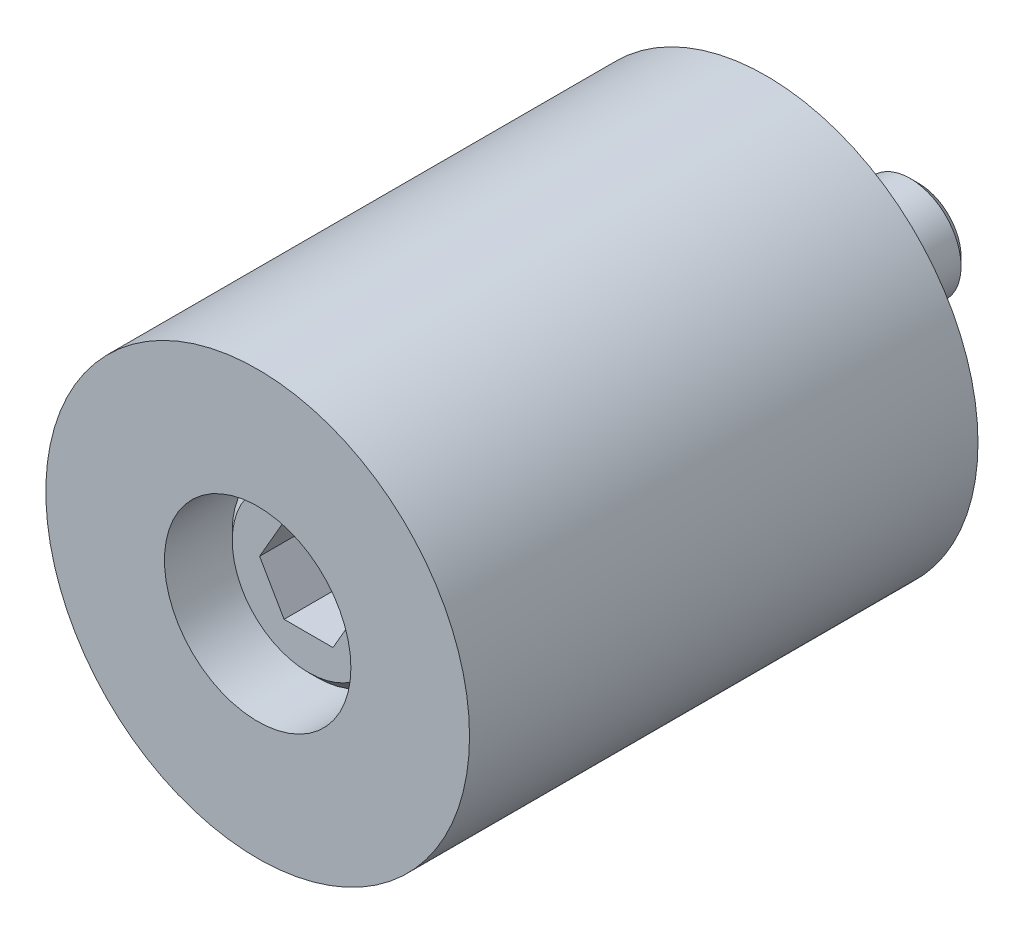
ISO-10303-21;
HEADER;
FILE_DESCRIPTION(('STEP AP214'),'2;1');
FILE_NAME('part.step','',(''),(''),'','','');
FILE_SCHEMA(('AUTOMOTIVE_DESIGN { 1 0 10303 214 1 1 1 1 }'));
ENDSEC;
DATA;
#1=APPLICATION_CONTEXT('core data for automotive mechanical design processes');
#2=APPLICATION_PROTOCOL_DEFINITION('international standard','automotive_design',2000,#1);
#3=PRODUCT_CONTEXT('',#1,'mechanical');
#4=PRODUCT('Part','Part','',(#3));
#5=PRODUCT_RELATED_PRODUCT_CATEGORY('part','',(#4));
#6=PRODUCT_DEFINITION_FORMATION('','',#4);
#7=PRODUCT_DEFINITION_CONTEXT('part definition',#1,'design');
#8=PRODUCT_DEFINITION('design','',#6,#7);
#9=PRODUCT_DEFINITION_SHAPE('','',#8);
#10=(LENGTH_UNIT() NAMED_UNIT(*) SI_UNIT(.MILLI.,.METRE.));
#11=(NAMED_UNIT(*) PLANE_ANGLE_UNIT() SI_UNIT($,.RADIAN.));
#12=(NAMED_UNIT(*) SI_UNIT($,.STERADIAN.) SOLID_ANGLE_UNIT());
#13=UNCERTAINTY_MEASURE_WITH_UNIT(LENGTH_MEASURE(1.E-05),#10,'distance_accuracy_value','');
#14=(GEOMETRIC_REPRESENTATION_CONTEXT(3) GLOBAL_UNCERTAINTY_ASSIGNED_CONTEXT((#13)) GLOBAL_UNIT_ASSIGNED_CONTEXT((#10,
#11,#12)) REPRESENTATION_CONTEXT('',''));
#15=CARTESIAN_POINT('',(0.,0.,0.));
#16=DIRECTION('',(0.,0.,1.));
#17=DIRECTION('',(1.,0.,0.));
#18=AXIS2_PLACEMENT_3D('',#15,#16,#17);
#19=CARTESIAN_POINT('',(0.,0.,15.));
#20=DIRECTION('',(0.,0.,-1.));
#21=DIRECTION('',(1.,0.,0.));
#22=AXIS2_PLACEMENT_3D('',#19,#20,#21);
#23=CYLINDRICAL_SURFACE('',#22,3.25);
#24=CARTESIAN_POINT('',(0.,0.,21.));
#25=DIRECTION('',(0.,0.,1.));
#26=DIRECTION('',(-1.,0.,0.));
#27=AXIS2_PLACEMENT_3D('',#24,#25,#26);
#28=CIRCLE('',#27,3.25);
#29=CARTESIAN_POINT('',(-3.25,0.,21.));
#30=VERTEX_POINT('',#29);
#31=CARTESIAN_POINT('',(3.25,0.,21.));
#32=VERTEX_POINT('',#31);
#33=EDGE_CURVE('P0_E36',#30,#32,#28,.T.);
#34=ORIENTED_EDGE('',*,*,#33,.T.);
#35=CARTESIAN_POINT('',(3.25,0.,20.9999983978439));
#36=CARTESIAN_POINT('',(3.25,0.,-2.14838709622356E-06));
#37=B_SPLINE_CURVE_WITH_KNOTS('',1,(#35,#36),.UNSPECIFIED.,.F.,.F.,(2,2),(0.0833333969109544,
0.916666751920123),.UNSPECIFIED.);
#38=CARTESIAN_POINT('',(3.25,0.,0.));
#39=VERTEX_POINT('',#38);
#40=EDGE_CURVE('P0_E25',#32,#39,#37,.T.);
#41=ORIENTED_EDGE('',*,*,#40,.T.);
#42=CARTESIAN_POINT('',(0.,0.,0.));
#43=DIRECTION('',(0.,0.,1.));
#44=DIRECTION('',(1.,0.,0.));
#45=AXIS2_PLACEMENT_3D('',#42,#43,#44);
#46=CIRCLE('',#45,3.25);
#47=EDGE_CURVE('P0_E11',#39,#39,#46,.T.);
#48=ORIENTED_EDGE('',*,*,#47,.F.);
#49=ORIENTED_EDGE('',*,*,#40,.F.);
#50=CARTESIAN_POINT('',(0.,0.,21.));
#51=DIRECTION('',(0.,0.,1.));
#52=DIRECTION('',(-1.,0.,0.));
#53=AXIS2_PLACEMENT_3D('',#50,#51,#52);
#54=CIRCLE('',#53,3.25);
#55=EDGE_CURVE('P0_E51',#32,#30,#54,.T.);
#56=ORIENTED_EDGE('',*,*,#55,.T.);
#57=EDGE_LOOP('',(#34,#41,#48,#49,#56));
#58=FACE_BOUND('',#57,.T.);
#59=ADVANCED_FACE('P0_F16',(#58),#23,.F.);
#60=CARTESIAN_POINT('',(0.,0.,25.5));
#61=DIRECTION('',(0.,0.,-1.));
#62=DIRECTION('',(1.,0.,0.));
#63=AXIS2_PLACEMENT_3D('',#60,#61,#62);
#64=CYLINDRICAL_SURFACE('',#63,5.5);
#65=CARTESIAN_POINT('',(0.,0.,30.));
#66=DIRECTION('',(0.,0.,-1.));
#67=DIRECTION('',(1.,0.,0.));
#68=AXIS2_PLACEMENT_3D('',#65,#66,#67);
#69=CIRCLE('',#68,5.5);
#70=CARTESIAN_POINT('',(5.5,0.,30.));
#71=VERTEX_POINT('',#70);
#72=EDGE_CURVE('P0_E53',#71,#71,#69,.T.);
#73=ORIENTED_EDGE('',*,*,#72,.F.);
#74=CARTESIAN_POINT('',(5.5,0.,30.0000013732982));
#75=CARTESIAN_POINT('',(5.5,0.,20.9999982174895));
#76=B_SPLINE_CURVE_WITH_KNOTS('',1,(#74,#75),.UNSPECIFIED.,.F.,.F.,(2,2),(0.0833332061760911,
0.916666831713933),.UNSPECIFIED.);
#77=CARTESIAN_POINT('',(5.5,0.,21.));
#78=VERTEX_POINT('',#77);
#79=EDGE_CURVE('P0_E91',#71,#78,#76,.T.);
#80=ORIENTED_EDGE('',*,*,#79,.T.);
#81=CARTESIAN_POINT('',(0.,0.,21.));
#82=DIRECTION('',(0.,0.,-1.));
#83=DIRECTION('',(1.,0.,0.));
#84=AXIS2_PLACEMENT_3D('',#81,#82,#83);
#85=CIRCLE('',#84,5.5);
#86=EDGE_CURVE('P0_E94',#78,#78,#85,.T.);
#87=ORIENTED_EDGE('',*,*,#86,.T.);
#88=ORIENTED_EDGE('',*,*,#79,.F.);
#89=EDGE_LOOP('',(#73,#80,#87,#88));
#90=FACE_BOUND('',#89,.T.);
#91=ADVANCED_FACE('P0_F111',(#90),#64,.F.);
#92=CARTESIAN_POINT('',(-12.65,11.4315353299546,21.));
#93=DIRECTION('',(0.,0.,-1.));
#94=DIRECTION('',(1.,0.,0.));
#95=AXIS2_PLACEMENT_3D('',#92,#93,#94);
#96=PLANE('',#95);
#97=ORIENTED_EDGE('',*,*,#86,.F.);
#98=EDGE_LOOP('',(#97));
#99=FACE_BOUND('',#98,.T.);
#100=ORIENTED_EDGE('',*,*,#55,.F.);
#101=ORIENTED_EDGE('',*,*,#33,.F.);
#102=EDGE_LOOP('',(#100,#101));
#103=FACE_BOUND('',#102,.T.);
#104=ADVANCED_FACE('P0_F55',(#99,#103),#96,.F.);
#105=CARTESIAN_POINT('',(0.,0.,15.));
#106=DIRECTION('',(0.,0.,1.));
#107=DIRECTION('',(1.,0.,0.));
#108=AXIS2_PLACEMENT_3D('',#105,#106,#107);
#109=CYLINDRICAL_SURFACE('',#108,12.5);
#110=CARTESIAN_POINT('',(0.,0.,0.));
#111=DIRECTION('',(0.,0.,-1.));
#112=DIRECTION('',(1.,0.,0.));
#113=AXIS2_PLACEMENT_3D('',#110,#111,#112);
#114=CIRCLE('',#113,12.5);
#115=CARTESIAN_POINT('',(12.5,0.,0.));
#116=VERTEX_POINT('',#115);
#117=EDGE_CURVE('P0_E85',#116,#116,#114,.T.);
#118=ORIENTED_EDGE('',*,*,#117,.F.);
#119=CARTESIAN_POINT('',(12.5,0.,-1.1444331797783E-06));
#120=CARTESIAN_POINT('',(12.5,0.,29.9999996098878));
#121=B_SPLINE_CURVE_WITH_KNOTS('',1,(#119,#120),.UNSPECIFIED.,.F.,.F.,(2,2),(0.0833333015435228,
0.916666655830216),.UNSPECIFIED.);
#122=CARTESIAN_POINT('',(12.5,0.,30.));
#123=VERTEX_POINT('',#122);
#124=EDGE_CURVE('P0_E57',#116,#123,#121,.T.);
#125=ORIENTED_EDGE('',*,*,#124,.T.);
#126=CARTESIAN_POINT('',(0.,0.,30.));
#127=DIRECTION('',(0.,0.,1.));
#128=DIRECTION('',(1.,0.,0.));
#129=AXIS2_PLACEMENT_3D('',#126,#127,#128);
#130=CIRCLE('',#129,12.5);
#131=EDGE_CURVE('P0_E82',#123,#123,#130,.T.);
#132=ORIENTED_EDGE('',*,*,#131,.F.);
#133=ORIENTED_EDGE('',*,*,#124,.F.);
#134=EDGE_LOOP('',(#118,#125,#132,#133));
#135=FACE_BOUND('',#134,.T.);
#136=ADVANCED_FACE('P0_F130',(#135),#109,.T.);
#137=CARTESIAN_POINT('',(16.25,-25.9807621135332,0.));
#138=DIRECTION('',(0.,0.,-1.));
#139=DIRECTION('',(-1.,0.,0.));
#140=AXIS2_PLACEMENT_3D('',#137,#138,#139);
#141=PLANE('',#140);
#142=ORIENTED_EDGE('',*,*,#117,.T.);
#143=EDGE_LOOP('',(#142));
#144=FACE_BOUND('',#143,.T.);
#145=ORIENTED_EDGE('',*,*,#47,.T.);
#146=EDGE_LOOP('',(#145));
#147=FACE_BOUND('',#146,.T.);
#148=ADVANCED_FACE('P0_F132',(#144,#147),#141,.T.);
#149=CARTESIAN_POINT('',(-28.75,-25.9807621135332,30.));
#150=DIRECTION('',(0.,0.,1.));
#151=DIRECTION('',(1.,0.,0.));
#152=AXIS2_PLACEMENT_3D('',#149,#150,#151);
#153=PLANE('',#152);
#154=ORIENTED_EDGE('',*,*,#131,.T.);
#155=EDGE_LOOP('',(#154));
#156=FACE_BOUND('',#155,.T.);
#157=ORIENTED_EDGE('',*,*,#72,.T.);
#158=EDGE_LOOP('',(#157));
#159=FACE_BOUND('',#158,.T.);
#160=ADVANCED_FACE('P0_F108',(#156,#159),#153,.T.);
#161=CLOSED_SHELL('',(#59,#91,#104,#136,#148,#160));
#162=MANIFOLD_SOLID_BREP('P0_B1',#161);
#163=CARTESIAN_POINT('',(0.,0.,-7.25735931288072));
#164=DIRECTION('',(0.,0.,1.));
#165=DIRECTION('',(-1.,0.,0.));
#166=AXIS2_PLACEMENT_3D('',#163,#164,#165);
#167=CONICAL_SURFACE('',#166,4.24264068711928,0.785398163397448);
#168=CARTESIAN_POINT('',(0.,0.,-9.));
#169=DIRECTION('',(0.,0.,1.));
#170=DIRECTION('',(1.,0.,0.));
#171=AXIS2_PLACEMENT_3D('',#168,#169,#170);
#172=CIRCLE('',#171,2.5);
#173=CARTESIAN_POINT('',(2.5,0.,-9.));
#174=VERTEX_POINT('',#173);
#175=CARTESIAN_POINT('',(-2.5,0.,-9.));
#176=VERTEX_POINT('',#175);
#177=EDGE_CURVE('P1_E37',#174,#176,#172,.T.);
#178=ORIENTED_EDGE('',*,*,#177,.T.);
#179=CARTESIAN_POINT('',(-2.49999945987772,0.,-9.00000054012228));
#180=CARTESIAN_POINT('',(-2.9999979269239,0.,-8.5000020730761));
#181=B_SPLINE_CURVE_WITH_KNOTS('',1,(#179,#180),.UNSPECIFIED.,.F.,.F.,(2,2),(0.589255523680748,
0.707106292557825),.UNSPECIFIED.);
#182=CARTESIAN_POINT('',(-3.,0.,-8.5));
#183=VERTEX_POINT('',#182);
#184=EDGE_CURVE('P1_E24',#176,#183,#181,.T.);
#185=ORIENTED_EDGE('',*,*,#184,.T.);
#186=CARTESIAN_POINT('',(0.,0.,-8.5));
#187=DIRECTION('',(0.,0.,-1.));
#188=DIRECTION('',(1.,0.,0.));
#189=AXIS2_PLACEMENT_3D('',#186,#187,#188);
#190=CIRCLE('',#189,3.);
#191=CARTESIAN_POINT('',(3.,0.,-8.5));
#192=VERTEX_POINT('',#191);
#193=EDGE_CURVE('P1_E173',#183,#192,#190,.T.);
#194=ORIENTED_EDGE('',*,*,#193,.T.);
#195=CARTESIAN_POINT('',(0.,0.,-8.5));
#196=DIRECTION('',(0.,0.,-1.));
#197=DIRECTION('',(1.,0.,0.));
#198=AXIS2_PLACEMENT_3D('',#195,#196,#197);
#199=CIRCLE('',#198,3.);
#200=EDGE_CURVE('P1_E10',#192,#183,#199,.T.);
#201=ORIENTED_EDGE('',*,*,#200,.T.);
#202=ORIENTED_EDGE('',*,*,#184,.F.);
#203=CARTESIAN_POINT('',(0.,0.,-9.));
#204=DIRECTION('',(0.,0.,1.));
#205=DIRECTION('',(1.,0.,0.));
#206=AXIS2_PLACEMENT_3D('',#203,#204,#205);
#207=CIRCLE('',#206,2.5);
#208=EDGE_CURVE('P1_E146',#176,#174,#207,.T.);
#209=ORIENTED_EDGE('',*,*,#208,.T.);
#210=EDGE_LOOP('',(#178,#185,#194,#201,#202,#209));
#211=FACE_BOUND('',#210,.T.);
#212=ADVANCED_FACE('P1_F15',(#211),#167,.T.);
#213=CARTESIAN_POINT('',(0.,0.,6.));
#214=DIRECTION('',(0.,0.,-1.));
#215=DIRECTION('',(1.,0.,0.));
#216=AXIS2_PLACEMENT_3D('',#213,#214,#215);
#217=CYLINDRICAL_SURFACE('',#216,3.);
#218=CARTESIAN_POINT('',(0.,0.,21.));
#219=DIRECTION('',(0.,0.,1.));
#220=DIRECTION('',(1.,0.,0.));
#221=AXIS2_PLACEMENT_3D('',#218,#219,#220);
#222=CIRCLE('',#221,3.);
#223=CARTESIAN_POINT('',(3.,0.,21.));
#224=VERTEX_POINT('',#223);
#225=EDGE_CURVE('P1_E154',#224,#224,#222,.T.);
#226=ORIENTED_EDGE('',*,*,#225,.F.);
#227=CARTESIAN_POINT('',(3.,0.,21.0000011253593));
#228=CARTESIAN_POINT('',(3.,0.,-8.49999961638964));
#229=B_SPLINE_CURVE_WITH_KNOTS('',1,(#227,#228),.UNSPECIFIED.,.F.,.F.,(2,2),(0.0833333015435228,
0.916666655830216),.UNSPECIFIED.);
#230=EDGE_CURVE('P1_E127',#224,#192,#229,.T.);
#231=ORIENTED_EDGE('',*,*,#230,.T.);
#232=ORIENTED_EDGE('',*,*,#193,.F.);
#233=ORIENTED_EDGE('',*,*,#200,.F.);
#234=ORIENTED_EDGE('',*,*,#230,.F.);
#235=EDGE_LOOP('',(#226,#231,#232,#233,#234));
#236=FACE_BOUND('',#235,.T.);
#237=ADVANCED_FACE('P1_F337',(#236),#217,.T.);
#238=CARTESIAN_POINT('',(-5.75,5.19615242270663,-9.));
#239=DIRECTION('',(0.,0.,-1.));
#240=DIRECTION('',(1.,0.,0.));
#241=AXIS2_PLACEMENT_3D('',#238,#239,#240);
#242=PLANE('',#241);
#243=ORIENTED_EDGE('',*,*,#208,.F.);
#244=ORIENTED_EDGE('',*,*,#177,.F.);
#245=EDGE_LOOP('',(#243,#244));
#246=FACE_BOUND('',#245,.T.);
#247=ADVANCED_FACE('P1_F340',(#246),#242,.T.);
#248=CARTESIAN_POINT('',(0.,0.,24.4289321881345));
#249=DIRECTION('',(0.,0.,-1.));
#250=DIRECTION('',(-1.,0.,0.));
#251=AXIS2_PLACEMENT_3D('',#248,#249,#250);
#252=CONICAL_SURFACE('',#251,7.07106781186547,0.785398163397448);
#253=CARTESIAN_POINT('',(0.,0.,27.));
#254=DIRECTION('',(0.,0.,-1.));
#255=DIRECTION('',(1.,0.,0.));
#256=AXIS2_PLACEMENT_3D('',#253,#254,#255);
#257=CIRCLE('',#256,4.5);
#258=CARTESIAN_POINT('',(4.5,0.,27.));
#259=VERTEX_POINT('',#258);
#260=CARTESIAN_POINT('',(-4.5,0.,27.));
#261=VERTEX_POINT('',#260);
#262=EDGE_CURVE('P1_E102',#259,#261,#257,.T.);
#263=ORIENTED_EDGE('',*,*,#262,.T.);
#264=CARTESIAN_POINT('',(-4.50000215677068,0.,26.9999978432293));
#265=CARTESIAN_POINT('',(-5.00000242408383,0.,26.4999975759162));
#266=B_SPLINE_CURVE_WITH_KNOTS('',1,(#264,#265),.UNSPECIFIED.,.F.,.F.,(2,2),(0.636396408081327,
0.70710712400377),.UNSPECIFIED.);
#267=CARTESIAN_POINT('',(-5.,0.,26.5));
#268=VERTEX_POINT('',#267);
#269=EDGE_CURVE('P1_E107',#261,#268,#266,.T.);
#270=ORIENTED_EDGE('',*,*,#269,.T.);
#271=CARTESIAN_POINT('',(0.,0.,26.5));
#272=DIRECTION('',(0.,0.,1.));
#273=DIRECTION('',(1.,0.,0.));
#274=AXIS2_PLACEMENT_3D('',#271,#272,#273);
#275=CIRCLE('',#274,5.);
#276=CARTESIAN_POINT('',(5.,0.,26.5));
#277=VERTEX_POINT('',#276);
#278=EDGE_CURVE('P1_E117',#268,#277,#275,.T.);
#279=ORIENTED_EDGE('',*,*,#278,.T.);
#280=CARTESIAN_POINT('',(0.,0.,26.5));
#281=DIRECTION('',(0.,0.,1.));
#282=DIRECTION('',(1.,0.,0.));
#283=AXIS2_PLACEMENT_3D('',#280,#281,#282);
#284=CIRCLE('',#283,5.);
#285=EDGE_CURVE('P1_E119',#277,#268,#284,.T.);
#286=ORIENTED_EDGE('',*,*,#285,.T.);
#287=ORIENTED_EDGE('',*,*,#269,.F.);
#288=CARTESIAN_POINT('',(0.,0.,27.));
#289=DIRECTION('',(0.,0.,-1.));
#290=DIRECTION('',(1.,0.,0.));
#291=AXIS2_PLACEMENT_3D('',#288,#289,#290);
#292=CIRCLE('',#291,4.5);
#293=EDGE_CURVE('P1_E109',#261,#259,#292,.T.);
#294=ORIENTED_EDGE('',*,*,#293,.T.);
#295=EDGE_LOOP('',(#263,#270,#279,#286,#287,#294));
#296=FACE_BOUND('',#295,.T.);
#297=ADVANCED_FACE('P1_F104',(#296),#252,.T.);
#298=CARTESIAN_POINT('',(0.,0.,24.));
#299=DIRECTION('',(0.,0.,1.));
#300=DIRECTION('',(1.,0.,0.));
#301=AXIS2_PLACEMENT_3D('',#298,#299,#300);
#302=CYLINDRICAL_SURFACE('',#301,5.);
#303=CARTESIAN_POINT('',(0.,0.,21.));
#304=DIRECTION('',(0.,0.,-1.));
#305=DIRECTION('',(1.,0.,0.));
#306=AXIS2_PLACEMENT_3D('',#303,#304,#305);
#307=CIRCLE('',#306,5.);
#308=CARTESIAN_POINT('',(5.,0.,21.));
#309=VERTEX_POINT('',#308);
#310=EDGE_CURVE('P1_E112',#309,#309,#307,.T.);
#311=ORIENTED_EDGE('',*,*,#310,.F.);
#312=CARTESIAN_POINT('',(5.,0.,21.000004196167));
#313=CARTESIAN_POINT('',(5.,0.,26.5000028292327));
#314=B_SPLINE_CURVE_WITH_KNOTS('',1,(#312,#313),.UNSPECIFIED.,.F.,.F.,(2,2),(0.0833339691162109,
0.916667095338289),.UNSPECIFIED.);
#315=EDGE_CURVE('P1_E317',#309,#277,#314,.T.);
#316=ORIENTED_EDGE('',*,*,#315,.T.);
#317=ORIENTED_EDGE('',*,*,#278,.F.);
#318=ORIENTED_EDGE('',*,*,#285,.F.);
#319=ORIENTED_EDGE('',*,*,#315,.F.);
#320=EDGE_LOOP('',(#311,#316,#317,#318,#319));
#321=FACE_BOUND('',#320,.T.);
#322=ADVANCED_FACE('P1_F348',(#321),#302,.T.);
#323=CARTESIAN_POINT('',(-10.35,-9.35307436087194,27.));
#324=DIRECTION('',(0.,0.,1.));
#325=DIRECTION('',(1.,0.,0.));
#326=AXIS2_PLACEMENT_3D('',#323,#324,#325);
#327=PLANE('',#326);
#328=ORIENTED_EDGE('',*,*,#293,.F.);
#329=ORIENTED_EDGE('',*,*,#262,.F.);
#330=EDGE_LOOP('',(#328,#329));
#331=FACE_BOUND('',#330,.T.);
#332=DIRECTION('',(-0.500000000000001,0.866025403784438,0.));
#333=VECTOR('',#332,1.);
#334=CARTESIAN_POINT('',(-1.44337567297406,-2.5,27.));
#335=LINE('',#334,#333);
#336=CARTESIAN_POINT('',(-1.44337567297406,-2.5,27.));
#337=VERTEX_POINT('',#336);
#338=CARTESIAN_POINT('',(-2.88675134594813,0.,27.));
#339=VERTEX_POINT('',#338);
#340=EDGE_CURVE('P1_E312',#337,#339,#335,.T.);
#341=ORIENTED_EDGE('',*,*,#340,.T.);
#342=DIRECTION('',(0.5,0.866025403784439,0.));
#343=VECTOR('',#342,1.);
#344=CARTESIAN_POINT('',(-2.88675134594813,0.,27.));
#345=LINE('',#344,#343);
#346=CARTESIAN_POINT('',(-1.44337567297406,2.5,27.));
#347=VERTEX_POINT('',#346);
#348=EDGE_CURVE('P1_E306',#339,#347,#345,.T.);
#349=ORIENTED_EDGE('',*,*,#348,.T.);
#350=DIRECTION('',(1.,0.,0.));
#351=VECTOR('',#350,1.);
#352=CARTESIAN_POINT('',(-1.44337567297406,2.5,27.));
#353=LINE('',#352,#351);
#354=CARTESIAN_POINT('',(1.44337567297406,2.5,27.));
#355=VERTEX_POINT('',#354);
#356=EDGE_CURVE('P1_E300',#347,#355,#353,.T.);
#357=ORIENTED_EDGE('',*,*,#356,.T.);
#358=DIRECTION('',(0.500000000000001,-0.866025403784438,0.));
#359=VECTOR('',#358,1.);
#360=CARTESIAN_POINT('',(1.44337567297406,2.5,27.));
#361=LINE('',#360,#359);
#362=CARTESIAN_POINT('',(2.88675134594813,0.,27.));
#363=VERTEX_POINT('',#362);
#364=EDGE_CURVE('P1_E294',#355,#363,#361,.T.);
#365=ORIENTED_EDGE('',*,*,#364,.T.);
#366=DIRECTION('',(-0.499999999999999,-0.866025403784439,0.));
#367=VECTOR('',#366,1.);
#368=CARTESIAN_POINT('',(2.88675134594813,0.,27.));
#369=LINE('',#368,#367);
#370=CARTESIAN_POINT('',(1.44337567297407,-2.5,27.));
#371=VERTEX_POINT('',#370);
#372=EDGE_CURVE('P1_E288',#363,#371,#369,.T.);
#373=ORIENTED_EDGE('',*,*,#372,.T.);
#374=DIRECTION('',(-1.,0.,0.));
#375=VECTOR('',#374,1.);
#376=CARTESIAN_POINT('',(1.44337567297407,-2.5,27.));
#377=LINE('',#376,#375);
#378=EDGE_CURVE('P1_E277',#371,#337,#377,.T.);
#379=ORIENTED_EDGE('',*,*,#378,.T.);
#380=EDGE_LOOP('',(#341,#349,#357,#365,#373,#379));
#381=FACE_BOUND('',#380,.T.);
#382=ADVANCED_FACE('P1_F114',(#331,#381),#327,.T.);
#383=CARTESIAN_POINT('',(0.,0.,24.5600391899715));
#384=DIRECTION('',(0.,0.,1.));
#385=DIRECTION('',(-1.,0.,0.));
#386=AXIS2_PLACEMENT_3D('',#383,#384,#385);
#387=CONICAL_SURFACE('',#386,3.81881307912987,1.02974425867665);
#388=CARTESIAN_POINT('',(0.,0.,22.275464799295));
#389=DIRECTION('',(0.,0.,-1.));
#390=DIRECTION('',(-1.,0.,0.));
#391=AXIS2_PLACEMENT_3D('',#388,#389,#390);
#392=CIRCLE('',#391,0.0166427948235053);
#393=CARTESIAN_POINT('',(-0.0166427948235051,0.,22.275464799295));
#394=VERTEX_POINT('',#393);
#395=EDGE_CURVE('P1_E216',#394,#394,#392,.T.);
#396=ORIENTED_EDGE('',*,*,#395,.T.);
#397=CARTESIAN_POINT('',(-0.0166398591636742,0.,22.2754630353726));
#398=CARTESIAN_POINT('',(-2.88675167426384,0.,24.000000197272));
#399=B_SPLINE_CURVE_WITH_KNOTS('',1,(#397,#398),.UNSPECIFIED.,.F.,.F.,(2,2),(0.0043573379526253,
0.755929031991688),.UNSPECIFIED.);
#400=CARTESIAN_POINT('',(-2.88675134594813,0.,24.));
#401=VERTEX_POINT('',#400);
#402=EDGE_CURVE('P1_E221',#394,#401,#399,.T.);
#403=ORIENTED_EDGE('',*,*,#402,.T.);
#404=CARTESIAN_POINT('',(-2.88675134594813,0.,24.));
#405=CARTESIAN_POINT('',(-2.1650635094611,-1.25,23.5663661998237));
#406=CARTESIAN_POINT('',(-1.44337567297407,-2.5,24.));
#407=(BOUNDED_CURVE() B_SPLINE_CURVE(2,(#404,#405,#406),.UNSPECIFIED.,.F.,
.F.) B_SPLINE_CURVE_WITH_KNOTS((3,3),(0.,2.92392578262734),
.UNSPECIFIED.) CURVE() GEOMETRIC_REPRESENTATION_ITEM() RATIONAL_B_SPLINE_CURVE((1.,
1.15470053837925,1.)) REPRESENTATION_ITEM(''));
#408=CARTESIAN_POINT('',(-1.44337567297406,-2.5,24.));
#409=VERTEX_POINT('',#408);
#410=EDGE_CURVE('P1_E227',#401,#409,#407,.T.);
#411=ORIENTED_EDGE('',*,*,#410,.T.);
#412=CARTESIAN_POINT('',(-1.44337567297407,-2.5,24.));
#413=CARTESIAN_POINT('',(0.,-2.5,23.5663661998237));
#414=CARTESIAN_POINT('',(1.44337567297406,-2.5,24.));
#415=(BOUNDED_CURVE() B_SPLINE_CURVE(2,(#412,#413,#414),.UNSPECIFIED.,.F.,
.F.) B_SPLINE_CURVE_WITH_KNOTS((3,3),(0.,2.92392578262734),
.UNSPECIFIED.) CURVE() GEOMETRIC_REPRESENTATION_ITEM() RATIONAL_B_SPLINE_CURVE((1.,
1.15470053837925,1.)) REPRESENTATION_ITEM(''));
#416=CARTESIAN_POINT('',(1.44337567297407,-2.5,24.));
#417=VERTEX_POINT('',#416);
#418=EDGE_CURVE('P1_E224',#409,#417,#415,.T.);
#419=ORIENTED_EDGE('',*,*,#418,.T.);
#420=CARTESIAN_POINT('',(1.44337567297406,-2.5,24.));
#421=CARTESIAN_POINT('',(2.16506350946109,-1.25,23.5663661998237));
#422=CARTESIAN_POINT('',(2.88675134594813,0.,24.));
#423=(BOUNDED_CURVE() B_SPLINE_CURVE(2,(#420,#421,#422),.UNSPECIFIED.,.F.,
.F.) B_SPLINE_CURVE_WITH_KNOTS((3,3),(0.,2.92392578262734),
.UNSPECIFIED.) CURVE() GEOMETRIC_REPRESENTATION_ITEM() RATIONAL_B_SPLINE_CURVE((1.,
1.15470053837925,1.)) REPRESENTATION_ITEM(''));
#424=CARTESIAN_POINT('',(2.88675134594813,0.,24.));
#425=VERTEX_POINT('',#424);
#426=EDGE_CURVE('P1_E267',#417,#425,#423,.T.);
#427=ORIENTED_EDGE('',*,*,#426,.T.);
#428=CARTESIAN_POINT('',(2.88675134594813,0.,24.));
#429=CARTESIAN_POINT('',(2.1650635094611,1.25,23.5663661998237));
#430=CARTESIAN_POINT('',(1.44337567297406,2.5,24.));
#431=(BOUNDED_CURVE() B_SPLINE_CURVE(2,(#428,#429,#430),.UNSPECIFIED.,.F.,
.F.) B_SPLINE_CURVE_WITH_KNOTS((3,3),(0.,2.92392578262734),
.UNSPECIFIED.) CURVE() GEOMETRIC_REPRESENTATION_ITEM() RATIONAL_B_SPLINE_CURVE((1.,
1.15470053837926,1.)) REPRESENTATION_ITEM(''));
#432=CARTESIAN_POINT('',(1.44337567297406,2.5,24.));
#433=VERTEX_POINT('',#432);
#434=EDGE_CURVE('P1_E257',#425,#433,#431,.T.);
#435=ORIENTED_EDGE('',*,*,#434,.T.);
#436=CARTESIAN_POINT('',(1.44337567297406,2.5,24.));
#437=CARTESIAN_POINT('',(0.,2.5,23.5663661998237));
#438=CARTESIAN_POINT('',(-1.44337567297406,2.5,24.));
#439=(BOUNDED_CURVE() B_SPLINE_CURVE(2,(#436,#437,#438),.UNSPECIFIED.,.F.,
.F.) B_SPLINE_CURVE_WITH_KNOTS((3,3),(0.,2.92392578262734),
.UNSPECIFIED.) CURVE() GEOMETRIC_REPRESENTATION_ITEM() RATIONAL_B_SPLINE_CURVE((1.,
1.15470053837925,1.)) REPRESENTATION_ITEM(''));
#440=CARTESIAN_POINT('',(-1.44337567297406,2.5,24.));
#441=VERTEX_POINT('',#440);
#442=EDGE_CURVE('P1_E247',#433,#441,#439,.T.);
#443=ORIENTED_EDGE('',*,*,#442,.T.);
#444=CARTESIAN_POINT('',(-1.44337567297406,2.5,24.));
#445=CARTESIAN_POINT('',(-2.1650635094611,1.25,23.5663661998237));
#446=CARTESIAN_POINT('',(-2.88675134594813,0.,24.));
#447=(BOUNDED_CURVE() B_SPLINE_CURVE(2,(#444,#445,#446),.UNSPECIFIED.,.F.,
.F.) B_SPLINE_CURVE_WITH_KNOTS((3,3),(0.,2.92392578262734),
.UNSPECIFIED.) CURVE() GEOMETRIC_REPRESENTATION_ITEM() RATIONAL_B_SPLINE_CURVE((1.,
1.15470053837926,1.)) REPRESENTATION_ITEM(''));
#448=EDGE_CURVE('P1_E237',#441,#401,#447,.T.);
#449=ORIENTED_EDGE('',*,*,#448,.T.);
#450=ORIENTED_EDGE('',*,*,#402,.F.);
#451=EDGE_LOOP('',(#396,#403,#411,#419,#427,#435,#443,#449,#450));
#452=FACE_BOUND('',#451,.T.);
#453=ADVANCED_FACE('P1_F390',(#452),#387,.F.);
#454=CARTESIAN_POINT('',(0.0382784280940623,-0.0345913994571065,22.275464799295));
#455=DIRECTION('',(0.,0.,-1.));
#456=DIRECTION('',(-1.,0.,0.));
#457=AXIS2_PLACEMENT_3D('',#454,#455,#456);
#458=PLANE('',#457);
#459=ORIENTED_EDGE('',*,*,#395,.F.);
#460=EDGE_LOOP('',(#459));
#461=FACE_BOUND('',#460,.T.);
#462=ADVANCED_FACE('P1_F398',(#461),#458,.F.);
#463=CARTESIAN_POINT('',(-1.29903810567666,-2.75,27.3433633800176));
#464=DIRECTION('',(-0.866025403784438,-0.5,0.));
#465=DIRECTION('',(-0.5,0.866025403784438,0.));
#466=AXIS2_PLACEMENT_3D('',#463,#464,#465);
#467=PLANE('',#466);
#468=DIRECTION('',(0.,0.,-1.));
#469=VECTOR('',#468,1.);
#470=CARTESIAN_POINT('',(-2.88675134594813,0.,27.));
#471=LINE('',#470,#469);
#472=EDGE_CURVE('P1_E210',#339,#401,#471,.T.);
#473=ORIENTED_EDGE('',*,*,#472,.F.);
#474=ORIENTED_EDGE('',*,*,#340,.F.);
#475=DIRECTION('',(0.,0.,-1.));
#476=VECTOR('',#475,1.);
#477=CARTESIAN_POINT('',(-1.44337567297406,-2.5,27.));
#478=LINE('',#477,#476);
#479=EDGE_CURVE('P1_E204',#337,#409,#478,.T.);
#480=ORIENTED_EDGE('',*,*,#479,.T.);
#481=ORIENTED_EDGE('',*,*,#410,.F.);
#482=EDGE_LOOP('',(#473,#474,#480,#481));
#483=FACE_BOUND('',#482,.T.);
#484=ADVANCED_FACE('P1_F407',(#483),#467,.F.);
#485=CARTESIAN_POINT('',(1.73205080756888,-2.5,27.3433633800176));
#486=DIRECTION('',(0.,-1.,0.));
#487=DIRECTION('',(-1.,0.,0.));
#488=AXIS2_PLACEMENT_3D('',#485,#486,#487);
#489=PLANE('',#488);
#490=ORIENTED_EDGE('',*,*,#479,.F.);
#491=ORIENTED_EDGE('',*,*,#378,.F.);
#492=DIRECTION('',(0.,0.,-1.));
#493=VECTOR('',#492,1.);
#494=CARTESIAN_POINT('',(1.44337567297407,-2.5,27.));
#495=LINE('',#494,#493);
#496=EDGE_CURVE('P1_E198',#371,#417,#495,.T.);
#497=ORIENTED_EDGE('',*,*,#496,.T.);
#498=ORIENTED_EDGE('',*,*,#418,.F.);
#499=EDGE_LOOP('',(#490,#491,#497,#498));
#500=FACE_BOUND('',#499,.T.);
#501=ADVANCED_FACE('P1_F416',(#500),#489,.F.);
#502=CARTESIAN_POINT('',(3.03108891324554,0.250000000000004,27.3433633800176));
#503=DIRECTION('',(0.866025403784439,-0.499999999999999,0.));
#504=DIRECTION('',(-0.499999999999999,-0.866025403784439,0.));
#505=AXIS2_PLACEMENT_3D('',#502,#503,#504);
#506=PLANE('',#505);
#507=ORIENTED_EDGE('',*,*,#496,.F.);
#508=ORIENTED_EDGE('',*,*,#372,.F.);
#509=DIRECTION('',(0.,0.,-1.));
#510=VECTOR('',#509,1.);
#511=CARTESIAN_POINT('',(2.88675134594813,0.,27.));
#512=LINE('',#511,#510);
#513=EDGE_CURVE('P1_E192',#363,#425,#512,.T.);
#514=ORIENTED_EDGE('',*,*,#513,.T.);
#515=ORIENTED_EDGE('',*,*,#426,.F.);
#516=EDGE_LOOP('',(#507,#508,#514,#515));
#517=FACE_BOUND('',#516,.T.);
#518=ADVANCED_FACE('P1_F425',(#517),#506,.F.);
#519=CARTESIAN_POINT('',(1.29903810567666,2.75,27.3433633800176));
#520=DIRECTION('',(0.866025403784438,0.500000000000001,0.));
#521=DIRECTION('',(0.500000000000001,-0.866025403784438,0.));
#522=AXIS2_PLACEMENT_3D('',#519,#520,#521);
#523=PLANE('',#522);
#524=ORIENTED_EDGE('',*,*,#513,.F.);
#525=ORIENTED_EDGE('',*,*,#364,.F.);
#526=DIRECTION('',(0.,0.,-1.));
#527=VECTOR('',#526,1.);
#528=CARTESIAN_POINT('',(1.44337567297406,2.5,27.));
#529=LINE('',#528,#527);
#530=EDGE_CURVE('P1_E186',#355,#433,#529,.T.);
#531=ORIENTED_EDGE('',*,*,#530,.T.);
#532=ORIENTED_EDGE('',*,*,#434,.F.);
#533=EDGE_LOOP('',(#524,#525,#531,#532));
#534=FACE_BOUND('',#533,.T.);
#535=ADVANCED_FACE('P1_F434',(#534),#523,.F.);
#536=CARTESIAN_POINT('',(-1.73205080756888,2.5,27.3433633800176));
#537=DIRECTION('',(0.,1.,0.));
#538=DIRECTION('',(1.,0.,0.));
#539=AXIS2_PLACEMENT_3D('',#536,#537,#538);
#540=PLANE('',#539);
#541=ORIENTED_EDGE('',*,*,#530,.F.);
#542=ORIENTED_EDGE('',*,*,#356,.F.);
#543=DIRECTION('',(0.,0.,-1.));
#544=VECTOR('',#543,1.);
#545=CARTESIAN_POINT('',(-1.44337567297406,2.5,27.));
#546=LINE('',#545,#544);
#547=EDGE_CURVE('P1_E178',#347,#441,#546,.T.);
#548=ORIENTED_EDGE('',*,*,#547,.T.);
#549=ORIENTED_EDGE('',*,*,#442,.F.);
#550=EDGE_LOOP('',(#541,#542,#548,#549));
#551=FACE_BOUND('',#550,.T.);
#552=ADVANCED_FACE('P1_F443',(#551),#540,.F.);
#553=CARTESIAN_POINT('',(-3.03108891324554,-0.250000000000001,27.3433633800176));
#554=DIRECTION('',(-0.866025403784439,0.5,0.));
#555=DIRECTION('',(0.5,0.866025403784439,0.));
#556=AXIS2_PLACEMENT_3D('',#553,#554,#555);
#557=PLANE('',#556);
#558=ORIENTED_EDGE('',*,*,#547,.F.);
#559=ORIENTED_EDGE('',*,*,#348,.F.);
#560=ORIENTED_EDGE('',*,*,#472,.T.);
#561=ORIENTED_EDGE('',*,*,#448,.F.);
#562=EDGE_LOOP('',(#558,#559,#560,#561));
#563=FACE_BOUND('',#562,.T.);
#564=ADVANCED_FACE('P1_F452',(#563),#557,.F.);
#565=CARTESIAN_POINT('',(6.5,-10.3923048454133,21.));
#566=DIRECTION('',(0.,0.,-1.));
#567=DIRECTION('',(-1.,0.,0.));
#568=AXIS2_PLACEMENT_3D('',#565,#566,#567);
#569=PLANE('',#568);
#570=ORIENTED_EDGE('',*,*,#310,.T.);
#571=EDGE_LOOP('',(#570));
#572=FACE_BOUND('',#571,.T.);
#573=ORIENTED_EDGE('',*,*,#225,.T.);
#574=EDGE_LOOP('',(#573));
#575=FACE_BOUND('',#574,.T.);
#576=ADVANCED_FACE('P1_F336',(#572,#575),#569,.T.);
#577=CLOSED_SHELL('',(#212,#237,#247,#297,#322,#382,#453,#462,#484,#501,#518,#535,#552,#564,#576));
#578=MANIFOLD_SOLID_BREP('P1_B1',#577);
#579=ADVANCED_BREP_SHAPE_REPRESENTATION('',(#18,#162,#578),#14);
#580=SHAPE_DEFINITION_REPRESENTATION(#9,#579);
ENDSEC;
END-ISO-10303-21;
